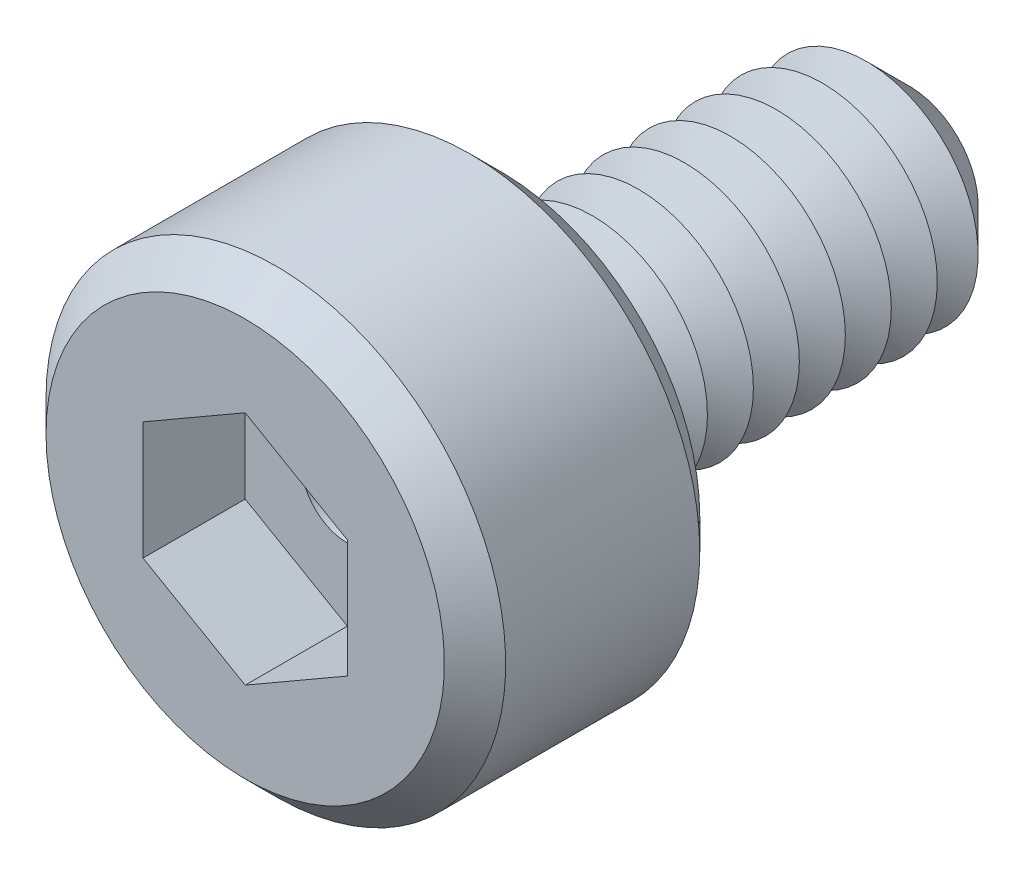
ISO-10303-21;
HEADER;
FILE_DESCRIPTION(('STEP AP214'),'2;1');
FILE_NAME('part.step','',(''),(''),'','','');
FILE_SCHEMA(('AUTOMOTIVE_DESIGN { 1 0 10303 214 1 1 1 1 }'));
ENDSEC;
DATA;
#1=APPLICATION_CONTEXT('core data for automotive mechanical design processes');
#2=APPLICATION_PROTOCOL_DEFINITION('international standard','automotive_design',2000,#1);
#3=PRODUCT_CONTEXT('',#1,'mechanical');
#4=PRODUCT('Part','Part','',(#3));
#5=PRODUCT_RELATED_PRODUCT_CATEGORY('part','',(#4));
#6=PRODUCT_DEFINITION_FORMATION('','',#4);
#7=PRODUCT_DEFINITION_CONTEXT('part definition',#1,'design');
#8=PRODUCT_DEFINITION('design','',#6,#7);
#9=PRODUCT_DEFINITION_SHAPE('','',#8);
#10=(LENGTH_UNIT() NAMED_UNIT(*) SI_UNIT(.MILLI.,.METRE.));
#11=(NAMED_UNIT(*) PLANE_ANGLE_UNIT() SI_UNIT($,.RADIAN.));
#12=(NAMED_UNIT(*) SI_UNIT($,.STERADIAN.) SOLID_ANGLE_UNIT());
#13=UNCERTAINTY_MEASURE_WITH_UNIT(LENGTH_MEASURE(1.E-05),#10,'distance_accuracy_value','');
#14=(GEOMETRIC_REPRESENTATION_CONTEXT(3) GLOBAL_UNCERTAINTY_ASSIGNED_CONTEXT((#13)) GLOBAL_UNIT_ASSIGNED_CONTEXT((#10,
#11,#12)) REPRESENTATION_CONTEXT('',''));
#15=CARTESIAN_POINT('',(0.,0.,0.));
#16=DIRECTION('',(0.,0.,1.));
#17=DIRECTION('',(1.,0.,0.));
#18=AXIS2_PLACEMENT_3D('',#15,#16,#17);
#19=CARTESIAN_POINT('',(0.,0.,2.5));
#20=DIRECTION('',(0.,0.,-1.));
#21=DIRECTION('',(-1.,0.,0.));
#22=AXIS2_PLACEMENT_3D('',#19,#20,#21);
#23=CYLINDRICAL_SURFACE('',#22,2.25);
#24=CARTESIAN_POINT('',(0.,0.,0.299999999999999));
#25=DIRECTION('',(0.,0.,1.));
#26=DIRECTION('',(1.,0.,0.));
#27=AXIS2_PLACEMENT_3D('',#24,#25,#26);
#28=CIRCLE('',#27,2.25);
#29=CARTESIAN_POINT('',(2.25,0.,0.299999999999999));
#30=VERTEX_POINT('',#29);
#31=EDGE_CURVE('E240',#30,#30,#28,.T.);
#32=ORIENTED_EDGE('',*,*,#31,.T.);
#33=EDGE_LOOP('',(#32));
#34=FACE_BOUND('',#33,.T.);
#35=CARTESIAN_POINT('',(0.,0.,2.2));
#36=DIRECTION('',(0.,0.,1.));
#37=DIRECTION('',(1.,0.,0.));
#38=AXIS2_PLACEMENT_3D('',#35,#36,#37);
#39=CIRCLE('',#38,2.25);
#40=CARTESIAN_POINT('',(-2.25,0.,2.2));
#41=VERTEX_POINT('',#40);
#42=EDGE_CURVE('E233',#41,#41,#39,.F.);
#43=ORIENTED_EDGE('',*,*,#42,.T.);
#44=EDGE_LOOP('',(#43));
#45=FACE_BOUND('',#44,.T.);
#46=ADVANCED_FACE('F39',(#34,#45),#23,.T.);
#47=CARTESIAN_POINT('',(0.,0.,2.5));
#48=DIRECTION('',(0.,0.,1.));
#49=DIRECTION('',(1.,0.,0.));
#50=AXIS2_PLACEMENT_3D('',#47,#48,#49);
#51=PLANE('',#50);
#52=CARTESIAN_POINT('',(0.,0.,2.5));
#53=DIRECTION('',(0.,0.,1.));
#54=DIRECTION('',(1.,0.,0.));
#55=AXIS2_PLACEMENT_3D('',#52,#53,#54);
#56=CIRCLE('',#55,1.95);
#57=CARTESIAN_POINT('',(-1.95,0.,2.5));
#58=VERTEX_POINT('',#57);
#59=EDGE_CURVE('E11',#58,#58,#56,.T.);
#60=ORIENTED_EDGE('',*,*,#59,.T.);
#61=EDGE_LOOP('',(#60));
#62=FACE_BOUND('',#61,.T.);
#63=DIRECTION('',(-0.866025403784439,0.5,0.));
#64=VECTOR('',#63,1.);
#65=CARTESIAN_POINT('',(1.,0.577350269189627,2.5));
#66=LINE('',#65,#64);
#67=CARTESIAN_POINT('',(1.,0.577350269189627,2.5));
#68=VERTEX_POINT('',#67);
#69=CARTESIAN_POINT('',(0.,1.15470053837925,2.5));
#70=VERTEX_POINT('',#69);
#71=EDGE_CURVE('E55',#68,#70,#66,.T.);
#72=ORIENTED_EDGE('',*,*,#71,.F.);
#73=DIRECTION('',(0.,1.,0.));
#74=VECTOR('',#73,1.);
#75=CARTESIAN_POINT('',(1.,-0.577350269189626,2.5));
#76=LINE('',#75,#74);
#77=CARTESIAN_POINT('',(1.,-0.577350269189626,2.5));
#78=VERTEX_POINT('',#77);
#79=EDGE_CURVE('E150',#78,#68,#76,.T.);
#80=ORIENTED_EDGE('',*,*,#79,.F.);
#81=DIRECTION('',(0.866025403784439,0.5,0.));
#82=VECTOR('',#81,1.);
#83=CARTESIAN_POINT('',(0.,-1.15470053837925,2.5));
#84=LINE('',#83,#82);
#85=CARTESIAN_POINT('',(0.,-1.15470053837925,2.5));
#86=VERTEX_POINT('',#85);
#87=EDGE_CURVE('E147',#86,#78,#84,.T.);
#88=ORIENTED_EDGE('',*,*,#87,.F.);
#89=DIRECTION('',(0.866025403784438,-0.5,0.));
#90=VECTOR('',#89,1.);
#91=CARTESIAN_POINT('',(-1.,-0.577350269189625,2.5));
#92=LINE('',#91,#90);
#93=CARTESIAN_POINT('',(-1.,-0.577350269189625,2.5));
#94=VERTEX_POINT('',#93);
#95=EDGE_CURVE('E103',#94,#86,#92,.T.);
#96=ORIENTED_EDGE('',*,*,#95,.F.);
#97=DIRECTION('',(0.,-1.,0.));
#98=VECTOR('',#97,1.);
#99=CARTESIAN_POINT('',(-1.,0.577350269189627,2.5));
#100=LINE('',#99,#98);
#101=CARTESIAN_POINT('',(-1.,0.577350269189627,2.5));
#102=VERTEX_POINT('',#101);
#103=EDGE_CURVE('E142',#102,#94,#100,.T.);
#104=ORIENTED_EDGE('',*,*,#103,.F.);
#105=DIRECTION('',(-0.866025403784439,-0.5,0.));
#106=VECTOR('',#105,1.);
#107=CARTESIAN_POINT('',(0.,1.15470053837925,2.5));
#108=LINE('',#107,#106);
#109=EDGE_CURVE('E137',#70,#102,#108,.T.);
#110=ORIENTED_EDGE('',*,*,#109,.F.);
#111=EDGE_LOOP('',(#72,#80,#88,#96,#104,#110));
#112=FACE_BOUND('',#111,.T.);
#113=ADVANCED_FACE('F258',(#62,#112),#51,.T.);
#114=CARTESIAN_POINT('',(0.,0.,0.));
#115=DIRECTION('',(0.,0.,1.));
#116=DIRECTION('',(1.,0.,0.));
#117=AXIS2_PLACEMENT_3D('',#114,#115,#116);
#118=PLANE('',#117);
#119=CARTESIAN_POINT('',(0.,0.,0.));
#120=DIRECTION('',(0.,0.,1.));
#121=DIRECTION('',(1.,0.,0.));
#122=AXIS2_PLACEMENT_3D('',#119,#120,#121);
#123=CIRCLE('',#122,1.95);
#124=CARTESIAN_POINT('',(1.95,0.,0.));
#125=VERTEX_POINT('',#124);
#126=EDGE_CURVE('E48',#125,#125,#123,.F.);
#127=ORIENTED_EDGE('',*,*,#126,.T.);
#128=EDGE_LOOP('',(#127));
#129=FACE_BOUND('',#128,.T.);
#130=CARTESIAN_POINT('',(0.,0.,0.));
#131=DIRECTION('',(0.,0.,1.));
#132=DIRECTION('',(1.,0.,0.));
#133=AXIS2_PLACEMENT_3D('',#130,#131,#132);
#134=CIRCLE('',#133,1.125);
#135=CARTESIAN_POINT('',(1.125,0.,0.));
#136=VERTEX_POINT('',#135);
#137=EDGE_CURVE('E225',#136,#136,#134,.T.);
#138=ORIENTED_EDGE('',*,*,#137,.T.);
#139=EDGE_LOOP('',(#138));
#140=FACE_BOUND('',#139,.T.);
#141=ADVANCED_FACE('F247',(#129,#140),#118,.F.);
#142=CARTESIAN_POINT('',(0.,0.,0.));
#143=DIRECTION('',(0.,0.,1.));
#144=DIRECTION('',(1.,0.,0.));
#145=AXIS2_PLACEMENT_3D('',#142,#143,#144);
#146=CONICAL_SURFACE('',#145,1.125,1.0471975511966);
#147=CARTESIAN_POINT('',(0.,0.,-0.225));
#148=DIRECTION('',(0.,0.,1.));
#149=DIRECTION('',(1.,0.,0.));
#150=AXIS2_PLACEMENT_3D('',#147,#148,#149);
#151=CIRCLE('',#150,0.735288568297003);
#152=CARTESIAN_POINT('',(0.735288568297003,0.,-0.225));
#153=VERTEX_POINT('',#152);
#154=EDGE_CURVE('E221',#153,#153,#151,.T.);
#155=ORIENTED_EDGE('',*,*,#154,.T.);
#156=EDGE_LOOP('',(#155));
#157=FACE_BOUND('',#156,.T.);
#158=ORIENTED_EDGE('',*,*,#137,.F.);
#159=EDGE_LOOP('',(#158));
#160=FACE_BOUND('',#159,.T.);
#161=ADVANCED_FACE('F372',(#157,#160),#146,.T.);
#162=CARTESIAN_POINT('',(0.,0.,-0.225));
#163=DIRECTION('',(0.,0.,-1.));
#164=DIRECTION('',(-1.,0.,0.));
#165=AXIS2_PLACEMENT_3D('',#162,#163,#164);
#166=CONICAL_SURFACE('',#165,0.735288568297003,1.0471975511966);
#167=CARTESIAN_POINT('',(0.,0.,-0.45));
#168=DIRECTION('',(0.,0.,1.));
#169=DIRECTION('',(1.,0.,0.));
#170=AXIS2_PLACEMENT_3D('',#167,#168,#169);
#171=CIRCLE('',#170,1.125);
#172=CARTESIAN_POINT('',(1.125,0.,-0.45));
#173=VERTEX_POINT('',#172);
#174=EDGE_CURVE('E217',#173,#173,#171,.T.);
#175=ORIENTED_EDGE('',*,*,#174,.T.);
#176=EDGE_LOOP('',(#175));
#177=FACE_BOUND('',#176,.T.);
#178=ORIENTED_EDGE('',*,*,#154,.F.);
#179=EDGE_LOOP('',(#178));
#180=FACE_BOUND('',#179,.T.);
#181=ADVANCED_FACE('F368',(#177,#180),#166,.T.);
#182=CARTESIAN_POINT('',(0.,0.,-0.45));
#183=DIRECTION('',(0.,0.,1.));
#184=DIRECTION('',(1.,0.,0.));
#185=AXIS2_PLACEMENT_3D('',#182,#183,#184);
#186=CONICAL_SURFACE('',#185,1.125,1.0471975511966);
#187=CARTESIAN_POINT('',(0.,0.,-0.675));
#188=DIRECTION('',(0.,0.,1.));
#189=DIRECTION('',(1.,0.,0.));
#190=AXIS2_PLACEMENT_3D('',#187,#188,#189);
#191=CIRCLE('',#190,0.735288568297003);
#192=CARTESIAN_POINT('',(0.735288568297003,0.,-0.675));
#193=VERTEX_POINT('',#192);
#194=EDGE_CURVE('E213',#193,#193,#191,.T.);
#195=ORIENTED_EDGE('',*,*,#194,.T.);
#196=EDGE_LOOP('',(#195));
#197=FACE_BOUND('',#196,.T.);
#198=ORIENTED_EDGE('',*,*,#174,.F.);
#199=EDGE_LOOP('',(#198));
#200=FACE_BOUND('',#199,.T.);
#201=ADVANCED_FACE('F364',(#197,#200),#186,.T.);
#202=CARTESIAN_POINT('',(0.,0.,-0.675));
#203=DIRECTION('',(0.,0.,-1.));
#204=DIRECTION('',(-1.,0.,0.));
#205=AXIS2_PLACEMENT_3D('',#202,#203,#204);
#206=CONICAL_SURFACE('',#205,0.735288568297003,1.0471975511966);
#207=CARTESIAN_POINT('',(0.,0.,-0.9));
#208=DIRECTION('',(0.,0.,1.));
#209=DIRECTION('',(1.,0.,0.));
#210=AXIS2_PLACEMENT_3D('',#207,#208,#209);
#211=CIRCLE('',#210,1.125);
#212=CARTESIAN_POINT('',(1.125,0.,-0.9));
#213=VERTEX_POINT('',#212);
#214=EDGE_CURVE('E210',#213,#213,#211,.T.);
#215=ORIENTED_EDGE('',*,*,#214,.T.);
#216=EDGE_LOOP('',(#215));
#217=FACE_BOUND('',#216,.T.);
#218=ORIENTED_EDGE('',*,*,#194,.F.);
#219=EDGE_LOOP('',(#218));
#220=FACE_BOUND('',#219,.T.);
#221=ADVANCED_FACE('F360',(#217,#220),#206,.T.);
#222=CARTESIAN_POINT('',(0.,0.,-0.9));
#223=DIRECTION('',(0.,0.,1.));
#224=DIRECTION('',(1.,0.,0.));
#225=AXIS2_PLACEMENT_3D('',#222,#223,#224);
#226=CONICAL_SURFACE('',#225,1.125,1.0471975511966);
#227=CARTESIAN_POINT('',(0.,0.,-1.125));
#228=DIRECTION('',(0.,0.,1.));
#229=DIRECTION('',(1.,0.,0.));
#230=AXIS2_PLACEMENT_3D('',#227,#228,#229);
#231=CIRCLE('',#230,0.735288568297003);
#232=CARTESIAN_POINT('',(0.735288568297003,0.,-1.125));
#233=VERTEX_POINT('',#232);
#234=EDGE_CURVE('E206',#233,#233,#231,.T.);
#235=ORIENTED_EDGE('',*,*,#234,.T.);
#236=EDGE_LOOP('',(#235));
#237=FACE_BOUND('',#236,.T.);
#238=ORIENTED_EDGE('',*,*,#214,.F.);
#239=EDGE_LOOP('',(#238));
#240=FACE_BOUND('',#239,.T.);
#241=ADVANCED_FACE('F356',(#237,#240),#226,.T.);
#242=CARTESIAN_POINT('',(0.,0.,-1.125));
#243=DIRECTION('',(0.,0.,-1.));
#244=DIRECTION('',(-1.,0.,0.));
#245=AXIS2_PLACEMENT_3D('',#242,#243,#244);
#246=CONICAL_SURFACE('',#245,0.735288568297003,1.0471975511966);
#247=CARTESIAN_POINT('',(0.,0.,-1.35));
#248=DIRECTION('',(0.,0.,1.));
#249=DIRECTION('',(1.,0.,0.));
#250=AXIS2_PLACEMENT_3D('',#247,#248,#249);
#251=CIRCLE('',#250,1.125);
#252=CARTESIAN_POINT('',(1.125,0.,-1.35));
#253=VERTEX_POINT('',#252);
#254=EDGE_CURVE('E202',#253,#253,#251,.T.);
#255=ORIENTED_EDGE('',*,*,#254,.T.);
#256=EDGE_LOOP('',(#255));
#257=FACE_BOUND('',#256,.T.);
#258=ORIENTED_EDGE('',*,*,#234,.F.);
#259=EDGE_LOOP('',(#258));
#260=FACE_BOUND('',#259,.T.);
#261=ADVANCED_FACE('F352',(#257,#260),#246,.T.);
#262=CARTESIAN_POINT('',(0.,0.,-1.35));
#263=DIRECTION('',(0.,0.,1.));
#264=DIRECTION('',(1.,0.,0.));
#265=AXIS2_PLACEMENT_3D('',#262,#263,#264);
#266=CONICAL_SURFACE('',#265,1.125,1.0471975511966);
#267=CARTESIAN_POINT('',(0.,0.,-1.575));
#268=DIRECTION('',(0.,0.,1.));
#269=DIRECTION('',(1.,0.,0.));
#270=AXIS2_PLACEMENT_3D('',#267,#268,#269);
#271=CIRCLE('',#270,0.735288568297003);
#272=CARTESIAN_POINT('',(0.735288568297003,0.,-1.575));
#273=VERTEX_POINT('',#272);
#274=EDGE_CURVE('E198',#273,#273,#271,.T.);
#275=ORIENTED_EDGE('',*,*,#274,.T.);
#276=EDGE_LOOP('',(#275));
#277=FACE_BOUND('',#276,.T.);
#278=ORIENTED_EDGE('',*,*,#254,.F.);
#279=EDGE_LOOP('',(#278));
#280=FACE_BOUND('',#279,.T.);
#281=ADVANCED_FACE('F348',(#277,#280),#266,.T.);
#282=CARTESIAN_POINT('',(0.,0.,-1.575));
#283=DIRECTION('',(0.,0.,-1.));
#284=DIRECTION('',(-1.,0.,0.));
#285=AXIS2_PLACEMENT_3D('',#282,#283,#284);
#286=CONICAL_SURFACE('',#285,0.735288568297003,1.0471975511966);
#287=CARTESIAN_POINT('',(0.,0.,-1.8));
#288=DIRECTION('',(0.,0.,1.));
#289=DIRECTION('',(1.,0.,0.));
#290=AXIS2_PLACEMENT_3D('',#287,#288,#289);
#291=CIRCLE('',#290,1.125);
#292=CARTESIAN_POINT('',(1.125,0.,-1.8));
#293=VERTEX_POINT('',#292);
#294=EDGE_CURVE('E194',#293,#293,#291,.T.);
#295=ORIENTED_EDGE('',*,*,#294,.T.);
#296=EDGE_LOOP('',(#295));
#297=FACE_BOUND('',#296,.T.);
#298=ORIENTED_EDGE('',*,*,#274,.F.);
#299=EDGE_LOOP('',(#298));
#300=FACE_BOUND('',#299,.T.);
#301=ADVANCED_FACE('F344',(#297,#300),#286,.T.);
#302=CARTESIAN_POINT('',(0.,0.,-1.8));
#303=DIRECTION('',(0.,0.,1.));
#304=DIRECTION('',(1.,0.,0.));
#305=AXIS2_PLACEMENT_3D('',#302,#303,#304);
#306=CONICAL_SURFACE('',#305,1.125,1.0471975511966);
#307=CARTESIAN_POINT('',(0.,0.,-2.025));
#308=DIRECTION('',(0.,0.,1.));
#309=DIRECTION('',(1.,0.,0.));
#310=AXIS2_PLACEMENT_3D('',#307,#308,#309);
#311=CIRCLE('',#310,0.735288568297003);
#312=CARTESIAN_POINT('',(0.735288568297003,0.,-2.025));
#313=VERTEX_POINT('',#312);
#314=EDGE_CURVE('E190',#313,#313,#311,.T.);
#315=ORIENTED_EDGE('',*,*,#314,.T.);
#316=EDGE_LOOP('',(#315));
#317=FACE_BOUND('',#316,.T.);
#318=ORIENTED_EDGE('',*,*,#294,.F.);
#319=EDGE_LOOP('',(#318));
#320=FACE_BOUND('',#319,.T.);
#321=ADVANCED_FACE('F340',(#317,#320),#306,.T.);
#322=CARTESIAN_POINT('',(0.,0.,-2.025));
#323=DIRECTION('',(0.,0.,-1.));
#324=DIRECTION('',(-1.,0.,0.));
#325=AXIS2_PLACEMENT_3D('',#322,#323,#324);
#326=CONICAL_SURFACE('',#325,0.735288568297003,1.0471975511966);
#327=CARTESIAN_POINT('',(0.,0.,-2.25));
#328=DIRECTION('',(0.,0.,1.));
#329=DIRECTION('',(1.,0.,0.));
#330=AXIS2_PLACEMENT_3D('',#327,#328,#329);
#331=CIRCLE('',#330,1.125);
#332=CARTESIAN_POINT('',(1.125,0.,-2.25));
#333=VERTEX_POINT('',#332);
#334=EDGE_CURVE('E186',#333,#333,#331,.T.);
#335=ORIENTED_EDGE('',*,*,#334,.T.);
#336=EDGE_LOOP('',(#335));
#337=FACE_BOUND('',#336,.T.);
#338=ORIENTED_EDGE('',*,*,#314,.F.);
#339=EDGE_LOOP('',(#338));
#340=FACE_BOUND('',#339,.T.);
#341=ADVANCED_FACE('F336',(#337,#340),#326,.T.);
#342=CARTESIAN_POINT('',(0.,0.,-2.25));
#343=DIRECTION('',(0.,0.,1.));
#344=DIRECTION('',(1.,0.,0.));
#345=AXIS2_PLACEMENT_3D('',#342,#343,#344);
#346=CONICAL_SURFACE('',#345,1.125,1.0471975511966);
#347=CARTESIAN_POINT('',(0.,0.,-2.475));
#348=DIRECTION('',(0.,0.,1.));
#349=DIRECTION('',(1.,0.,0.));
#350=AXIS2_PLACEMENT_3D('',#347,#348,#349);
#351=CIRCLE('',#350,0.735288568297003);
#352=CARTESIAN_POINT('',(0.735288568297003,0.,-2.475));
#353=VERTEX_POINT('',#352);
#354=EDGE_CURVE('E182',#353,#353,#351,.T.);
#355=ORIENTED_EDGE('',*,*,#354,.T.);
#356=EDGE_LOOP('',(#355));
#357=FACE_BOUND('',#356,.T.);
#358=ORIENTED_EDGE('',*,*,#334,.F.);
#359=EDGE_LOOP('',(#358));
#360=FACE_BOUND('',#359,.T.);
#361=ADVANCED_FACE('F332',(#357,#360),#346,.T.);
#362=CARTESIAN_POINT('',(0.,0.,-2.475));
#363=DIRECTION('',(0.,0.,-1.));
#364=DIRECTION('',(-1.,0.,0.));
#365=AXIS2_PLACEMENT_3D('',#362,#363,#364);
#366=CONICAL_SURFACE('',#365,0.735288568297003,1.0471975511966);
#367=CARTESIAN_POINT('',(0.,0.,-2.7));
#368=DIRECTION('',(0.,0.,1.));
#369=DIRECTION('',(1.,0.,0.));
#370=AXIS2_PLACEMENT_3D('',#367,#368,#369);
#371=CIRCLE('',#370,1.125);
#372=CARTESIAN_POINT('',(1.125,0.,-2.7));
#373=VERTEX_POINT('',#372);
#374=EDGE_CURVE('E178',#373,#373,#371,.T.);
#375=ORIENTED_EDGE('',*,*,#374,.T.);
#376=EDGE_LOOP('',(#375));
#377=FACE_BOUND('',#376,.T.);
#378=ORIENTED_EDGE('',*,*,#354,.F.);
#379=EDGE_LOOP('',(#378));
#380=FACE_BOUND('',#379,.T.);
#381=ADVANCED_FACE('F328',(#377,#380),#366,.T.);
#382=CARTESIAN_POINT('',(0.,0.,-2.7));
#383=DIRECTION('',(0.,0.,1.));
#384=DIRECTION('',(1.,0.,0.));
#385=AXIS2_PLACEMENT_3D('',#382,#383,#384);
#386=CONICAL_SURFACE('',#385,1.125,1.0471975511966);
#387=CARTESIAN_POINT('',(0.,0.,-2.925));
#388=DIRECTION('',(0.,0.,1.));
#389=DIRECTION('',(1.,0.,0.));
#390=AXIS2_PLACEMENT_3D('',#387,#388,#389);
#391=CIRCLE('',#390,0.735288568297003);
#392=CARTESIAN_POINT('',(0.735288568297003,0.,-2.925));
#393=VERTEX_POINT('',#392);
#394=EDGE_CURVE('E174',#393,#393,#391,.T.);
#395=ORIENTED_EDGE('',*,*,#394,.T.);
#396=EDGE_LOOP('',(#395));
#397=FACE_BOUND('',#396,.T.);
#398=ORIENTED_EDGE('',*,*,#374,.F.);
#399=EDGE_LOOP('',(#398));
#400=FACE_BOUND('',#399,.T.);
#401=ADVANCED_FACE('F324',(#397,#400),#386,.T.);
#402=CARTESIAN_POINT('',(0.,0.,-2.925));
#403=DIRECTION('',(0.,0.,-1.));
#404=DIRECTION('',(-1.,0.,0.));
#405=AXIS2_PLACEMENT_3D('',#402,#403,#404);
#406=CONICAL_SURFACE('',#405,0.735288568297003,1.0471975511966);
#407=CARTESIAN_POINT('',(0.,0.,-3.15));
#408=DIRECTION('',(0.,0.,1.));
#409=DIRECTION('',(1.,0.,0.));
#410=AXIS2_PLACEMENT_3D('',#407,#408,#409);
#411=CIRCLE('',#410,1.125);
#412=CARTESIAN_POINT('',(1.125,0.,-3.15));
#413=VERTEX_POINT('',#412);
#414=EDGE_CURVE('E169',#413,#413,#411,.T.);
#415=ORIENTED_EDGE('',*,*,#414,.T.);
#416=EDGE_LOOP('',(#415));
#417=FACE_BOUND('',#416,.T.);
#418=ORIENTED_EDGE('',*,*,#394,.F.);
#419=EDGE_LOOP('',(#418));
#420=FACE_BOUND('',#419,.T.);
#421=ADVANCED_FACE('F320',(#417,#420),#406,.T.);
#422=CARTESIAN_POINT('',(0.,0.,-3.15));
#423=DIRECTION('',(0.,0.,1.));
#424=DIRECTION('',(1.,0.,0.));
#425=AXIS2_PLACEMENT_3D('',#422,#423,#424);
#426=CONICAL_SURFACE('',#425,1.125,1.0471975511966);
#427=CARTESIAN_POINT('',(0.,0.,-3.375));
#428=DIRECTION('',(0.,0.,1.));
#429=DIRECTION('',(1.,0.,0.));
#430=AXIS2_PLACEMENT_3D('',#427,#428,#429);
#431=CIRCLE('',#430,0.735288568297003);
#432=CARTESIAN_POINT('',(0.735288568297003,0.,-3.375));
#433=VERTEX_POINT('',#432);
#434=EDGE_CURVE('E156',#433,#433,#431,.T.);
#435=ORIENTED_EDGE('',*,*,#434,.T.);
#436=EDGE_LOOP('',(#435));
#437=FACE_BOUND('',#436,.T.);
#438=ORIENTED_EDGE('',*,*,#414,.F.);
#439=EDGE_LOOP('',(#438));
#440=FACE_BOUND('',#439,.T.);
#441=ADVANCED_FACE('F316',(#437,#440),#426,.T.);
#442=CARTESIAN_POINT('',(0.,0.,-3.375));
#443=DIRECTION('',(0.,0.,-1.));
#444=DIRECTION('',(-1.,0.,0.));
#445=AXIS2_PLACEMENT_3D('',#442,#443,#444);
#446=CONICAL_SURFACE('',#445,0.735288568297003,1.0471975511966);
#447=CARTESIAN_POINT('',(0.,0.,-3.58169872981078));
#448=DIRECTION('',(0.,0.,-1.));
#449=DIRECTION('',(-1.,0.,0.));
#450=AXIS2_PLACEMENT_3D('',#447,#448,#449);
#451=CIRCLE('',#450,1.09330127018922);
#452=CARTESIAN_POINT('',(-1.09330127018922,0.,-3.58169872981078));
#453=VERTEX_POINT('',#452);
#454=EDGE_CURVE('E173',#453,#453,#451,.T.);
#455=ORIENTED_EDGE('',*,*,#454,.F.);
#456=EDGE_LOOP('',(#455));
#457=FACE_BOUND('',#456,.T.);
#458=ORIENTED_EDGE('',*,*,#434,.F.);
#459=EDGE_LOOP('',(#458));
#460=FACE_BOUND('',#459,.T.);
#461=ADVANCED_FACE('F312',(#457,#460),#446,.T.);
#462=CARTESIAN_POINT('',(0.,0.,-4.));
#463=DIRECTION('',(0.,0.,-1.));
#464=DIRECTION('',(-1.,0.,0.));
#465=AXIS2_PLACEMENT_3D('',#462,#463,#464);
#466=PLANE('',#465);
#467=CARTESIAN_POINT('',(0.,0.,-4.));
#468=DIRECTION('',(0.,0.,-1.));
#469=DIRECTION('',(-1.,0.,0.));
#470=AXIS2_PLACEMENT_3D('',#467,#468,#469);
#471=CIRCLE('',#470,0.45);
#472=CARTESIAN_POINT('',(-0.45,0.,-4.));
#473=VERTEX_POINT('',#472);
#474=EDGE_CURVE('E138',#473,#473,#471,.F.);
#475=ORIENTED_EDGE('',*,*,#474,.T.);
#476=EDGE_LOOP('',(#475));
#477=FACE_BOUND('',#476,.T.);
#478=CARTESIAN_POINT('',(0.,0.,-4.));
#479=DIRECTION('',(0.,0.,-1.));
#480=DIRECTION('',(-1.,0.,0.));
#481=AXIS2_PLACEMENT_3D('',#478,#479,#480);
#482=CIRCLE('',#481,0.675);
#483=CARTESIAN_POINT('',(-0.675,0.,-4.));
#484=VERTEX_POINT('',#483);
#485=EDGE_CURVE('E229',#484,#484,#482,.T.);
#486=ORIENTED_EDGE('',*,*,#485,.T.);
#487=EDGE_LOOP('',(#486));
#488=FACE_BOUND('',#487,.T.);
#489=ADVANCED_FACE('F315',(#477,#488),#466,.T.);
#490=CARTESIAN_POINT('',(0.,0.,-4.));
#491=DIRECTION('',(0.,0.,1.));
#492=DIRECTION('',(1.,0.,0.));
#493=AXIS2_PLACEMENT_3D('',#490,#491,#492);
#494=CONICAL_SURFACE('',#493,0.675,0.785398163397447);
#495=ORIENTED_EDGE('',*,*,#485,.F.);
#496=EDGE_LOOP('',(#495));
#497=FACE_BOUND('',#496,.T.);
#498=ORIENTED_EDGE('',*,*,#454,.T.);
#499=EDGE_LOOP('',(#498));
#500=FACE_BOUND('',#499,.T.);
#501=ADVANCED_FACE('F311',(#497,#500),#494,.T.);
#502=CARTESIAN_POINT('',(1.,0.577350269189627,1.5));
#503=DIRECTION('',(0.5,0.866025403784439,0.));
#504=DIRECTION('',(-0.866025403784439,0.5,0.));
#505=AXIS2_PLACEMENT_3D('',#502,#503,#504);
#506=PLANE('',#505);
#507=ORIENTED_EDGE('',*,*,#71,.T.);
#508=DIRECTION('',(0.,0.,1.));
#509=VECTOR('',#508,1.);
#510=CARTESIAN_POINT('',(0.,1.15470053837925,1.5));
#511=LINE('',#510,#509);
#512=CARTESIAN_POINT('',(0.,1.15470053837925,1.5));
#513=VERTEX_POINT('',#512);
#514=EDGE_CURVE('E85',#513,#70,#511,.T.);
#515=ORIENTED_EDGE('',*,*,#514,.F.);
#516=DIRECTION('',(-0.866025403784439,0.5,0.));
#517=VECTOR('',#516,1.);
#518=CARTESIAN_POINT('',(1.,0.577350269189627,1.5));
#519=LINE('',#518,#517);
#520=CARTESIAN_POINT('',(1.,0.577350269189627,1.5));
#521=VERTEX_POINT('',#520);
#522=EDGE_CURVE('E153',#521,#513,#519,.T.);
#523=ORIENTED_EDGE('',*,*,#522,.F.);
#524=DIRECTION('',(0.,0.,1.));
#525=VECTOR('',#524,1.);
#526=CARTESIAN_POINT('',(1.,0.577350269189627,1.5));
#527=LINE('',#526,#525);
#528=EDGE_CURVE('E63',#521,#68,#527,.T.);
#529=ORIENTED_EDGE('',*,*,#528,.T.);
#530=EDGE_LOOP('',(#507,#515,#523,#529));
#531=FACE_BOUND('',#530,.T.);
#532=ADVANCED_FACE('F301',(#531),#506,.F.);
#533=CARTESIAN_POINT('',(1.,-0.577350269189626,1.5));
#534=DIRECTION('',(1.,0.,0.));
#535=DIRECTION('',(0.,0.,-1.));
#536=AXIS2_PLACEMENT_3D('',#533,#534,#535);
#537=PLANE('',#536);
#538=ORIENTED_EDGE('',*,*,#79,.T.);
#539=ORIENTED_EDGE('',*,*,#528,.F.);
#540=DIRECTION('',(0.,1.,0.));
#541=VECTOR('',#540,1.);
#542=CARTESIAN_POINT('',(1.,-0.577350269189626,1.5));
#543=LINE('',#542,#541);
#544=CARTESIAN_POINT('',(1.,-0.577350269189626,1.5));
#545=VERTEX_POINT('',#544);
#546=EDGE_CURVE('E117',#545,#521,#543,.T.);
#547=ORIENTED_EDGE('',*,*,#546,.F.);
#548=DIRECTION('',(0.,0.,1.));
#549=VECTOR('',#548,1.);
#550=CARTESIAN_POINT('',(1.,-0.577350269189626,1.5));
#551=LINE('',#550,#549);
#552=EDGE_CURVE('E108',#545,#78,#551,.T.);
#553=ORIENTED_EDGE('',*,*,#552,.T.);
#554=EDGE_LOOP('',(#538,#539,#547,#553));
#555=FACE_BOUND('',#554,.T.);
#556=ADVANCED_FACE('F298',(#555),#537,.F.);
#557=CARTESIAN_POINT('',(0.,-1.15470053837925,1.5));
#558=DIRECTION('',(0.5,-0.866025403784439,0.));
#559=DIRECTION('',(0.866025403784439,0.5,0.));
#560=AXIS2_PLACEMENT_3D('',#557,#558,#559);
#561=PLANE('',#560);
#562=ORIENTED_EDGE('',*,*,#87,.T.);
#563=ORIENTED_EDGE('',*,*,#552,.F.);
#564=DIRECTION('',(0.866025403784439,0.5,0.));
#565=VECTOR('',#564,1.);
#566=CARTESIAN_POINT('',(0.,-1.15470053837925,1.5));
#567=LINE('',#566,#565);
#568=CARTESIAN_POINT('',(0.,-1.15470053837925,1.5));
#569=VERTEX_POINT('',#568);
#570=EDGE_CURVE('E112',#569,#545,#567,.T.);
#571=ORIENTED_EDGE('',*,*,#570,.F.);
#572=DIRECTION('',(0.,0.,1.));
#573=VECTOR('',#572,1.);
#574=CARTESIAN_POINT('',(0.,-1.15470053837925,1.5));
#575=LINE('',#574,#573);
#576=EDGE_CURVE('E96',#569,#86,#575,.T.);
#577=ORIENTED_EDGE('',*,*,#576,.T.);
#578=EDGE_LOOP('',(#562,#563,#571,#577));
#579=FACE_BOUND('',#578,.T.);
#580=ADVANCED_FACE('F113',(#579),#561,.F.);
#581=CARTESIAN_POINT('',(-1.,-0.577350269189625,1.5));
#582=DIRECTION('',(-0.5,-0.866025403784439,0.));
#583=DIRECTION('',(0.866025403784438,-0.5,0.));
#584=AXIS2_PLACEMENT_3D('',#581,#582,#583);
#585=PLANE('',#584);
#586=ORIENTED_EDGE('',*,*,#95,.T.);
#587=ORIENTED_EDGE('',*,*,#576,.F.);
#588=DIRECTION('',(0.866025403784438,-0.5,0.));
#589=VECTOR('',#588,1.);
#590=CARTESIAN_POINT('',(-1.,-0.577350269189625,1.5));
#591=LINE('',#590,#589);
#592=CARTESIAN_POINT('',(-1.,-0.577350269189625,1.5));
#593=VERTEX_POINT('',#592);
#594=EDGE_CURVE('E100',#593,#569,#591,.T.);
#595=ORIENTED_EDGE('',*,*,#594,.F.);
#596=DIRECTION('',(0.,0.,1.));
#597=VECTOR('',#596,1.);
#598=CARTESIAN_POINT('',(-1.,-0.577350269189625,1.5));
#599=LINE('',#598,#597);
#600=EDGE_CURVE('E109',#593,#94,#599,.T.);
#601=ORIENTED_EDGE('',*,*,#600,.T.);
#602=EDGE_LOOP('',(#586,#587,#595,#601));
#603=FACE_BOUND('',#602,.T.);
#604=ADVANCED_FACE('F98',(#603),#585,.F.);
#605=CARTESIAN_POINT('',(-1.,0.577350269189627,1.5));
#606=DIRECTION('',(-1.,0.,0.));
#607=DIRECTION('',(0.,0.,1.));
#608=AXIS2_PLACEMENT_3D('',#605,#606,#607);
#609=PLANE('',#608);
#610=ORIENTED_EDGE('',*,*,#103,.T.);
#611=ORIENTED_EDGE('',*,*,#600,.F.);
#612=DIRECTION('',(0.,-1.,0.));
#613=VECTOR('',#612,1.);
#614=CARTESIAN_POINT('',(-1.,0.577350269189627,1.5));
#615=LINE('',#614,#613);
#616=CARTESIAN_POINT('',(-1.,0.577350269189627,1.5));
#617=VERTEX_POINT('',#616);
#618=EDGE_CURVE('E123',#617,#593,#615,.T.);
#619=ORIENTED_EDGE('',*,*,#618,.F.);
#620=DIRECTION('',(0.,0.,1.));
#621=VECTOR('',#620,1.);
#622=CARTESIAN_POINT('',(-1.,0.577350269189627,1.5));
#623=LINE('',#622,#621);
#624=EDGE_CURVE('E161',#617,#102,#623,.T.);
#625=ORIENTED_EDGE('',*,*,#624,.T.);
#626=EDGE_LOOP('',(#610,#611,#619,#625));
#627=FACE_BOUND('',#626,.T.);
#628=ADVANCED_FACE('F295',(#627),#609,.F.);
#629=CARTESIAN_POINT('',(0.,1.15470053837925,1.5));
#630=DIRECTION('',(-0.5,0.866025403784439,0.));
#631=DIRECTION('',(-0.866025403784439,-0.5,0.));
#632=AXIS2_PLACEMENT_3D('',#629,#630,#631);
#633=PLANE('',#632);
#634=ORIENTED_EDGE('',*,*,#109,.T.);
#635=ORIENTED_EDGE('',*,*,#624,.F.);
#636=DIRECTION('',(-0.866025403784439,-0.5,0.));
#637=VECTOR('',#636,1.);
#638=CARTESIAN_POINT('',(0.,1.15470053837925,1.5));
#639=LINE('',#638,#637);
#640=EDGE_CURVE('E129',#513,#617,#639,.T.);
#641=ORIENTED_EDGE('',*,*,#640,.F.);
#642=ORIENTED_EDGE('',*,*,#514,.T.);
#643=EDGE_LOOP('',(#634,#635,#641,#642));
#644=FACE_BOUND('',#643,.T.);
#645=ADVANCED_FACE('F273',(#644),#633,.F.);
#646=CARTESIAN_POINT('',(0.,0.,1.5));
#647=DIRECTION('',(0.,0.,1.));
#648=DIRECTION('',(1.,0.,0.));
#649=AXIS2_PLACEMENT_3D('',#646,#647,#648);
#650=PLANE('',#649);
#651=CARTESIAN_POINT('',(0.,0.,1.5));
#652=DIRECTION('',(0.,0.,1.));
#653=DIRECTION('',(1.,0.,0.));
#654=AXIS2_PLACEMENT_3D('',#651,#652,#653);
#655=CIRCLE('',#654,0.45);
#656=CARTESIAN_POINT('',(0.45,0.,1.5));
#657=VERTEX_POINT('',#656);
#658=EDGE_CURVE('E281',#657,#657,#655,.T.);
#659=ORIENTED_EDGE('',*,*,#658,.F.);
#660=EDGE_LOOP('',(#659));
#661=FACE_BOUND('',#660,.T.);
#662=ORIENTED_EDGE('',*,*,#522,.T.);
#663=ORIENTED_EDGE('',*,*,#640,.T.);
#664=ORIENTED_EDGE('',*,*,#618,.T.);
#665=ORIENTED_EDGE('',*,*,#594,.T.);
#666=ORIENTED_EDGE('',*,*,#570,.T.);
#667=ORIENTED_EDGE('',*,*,#546,.T.);
#668=EDGE_LOOP('',(#662,#663,#664,#665,#666,#667));
#669=FACE_BOUND('',#668,.T.);
#670=ADVANCED_FACE('F120',(#661,#669),#650,.T.);
#671=CARTESIAN_POINT('',(0.,0.,-5.27279220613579));
#672=DIRECTION('',(0.,0.,1.));
#673=DIRECTION('',(1.,0.,0.));
#674=AXIS2_PLACEMENT_3D('',#671,#672,#673);
#675=CYLINDRICAL_SURFACE('',#674,0.45);
#676=ORIENTED_EDGE('',*,*,#658,.T.);
#677=EDGE_LOOP('',(#676));
#678=FACE_BOUND('',#677,.T.);
#679=ORIENTED_EDGE('',*,*,#474,.F.);
#680=EDGE_LOOP('',(#679));
#681=FACE_BOUND('',#680,.T.);
#682=ADVANCED_FACE('F253',(#678,#681),#675,.F.);
#683=CARTESIAN_POINT('',(0.,0.,0.299999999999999));
#684=DIRECTION('',(0.,0.,1.));
#685=DIRECTION('',(1.,0.,0.));
#686=AXIS2_PLACEMENT_3D('',#683,#684,#685);
#687=CONICAL_SURFACE('',#686,2.25,0.785398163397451);
#688=ORIENTED_EDGE('',*,*,#126,.F.);
#689=EDGE_LOOP('',(#688));
#690=FACE_BOUND('',#689,.T.);
#691=ORIENTED_EDGE('',*,*,#31,.F.);
#692=EDGE_LOOP('',(#691));
#693=FACE_BOUND('',#692,.T.);
#694=ADVANCED_FACE('F250',(#690,#693),#687,.T.);
#695=CARTESIAN_POINT('',(0.,0.,2.5));
#696=DIRECTION('',(0.,0.,-1.));
#697=DIRECTION('',(-1.,0.,0.));
#698=AXIS2_PLACEMENT_3D('',#695,#696,#697);
#699=CONICAL_SURFACE('',#698,1.95,0.785398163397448);
#700=CARTESIAN_POINT('',(-2.25,0.,2.2));
#701=CARTESIAN_POINT('',(-2.246875,0.,2.203125));
#702=CARTESIAN_POINT('',(-2.24375,0.,2.20625));
#703=CARTESIAN_POINT('',(-2.2375,0.,2.2125));
#704=CARTESIAN_POINT('',(-2.234375,0.,2.215625));
#705=CARTESIAN_POINT('',(-2.228125,0.,2.221875));
#706=CARTESIAN_POINT('',(-2.225,0.,2.225));
#707=CARTESIAN_POINT('',(-2.21875,0.,2.23125));
#708=CARTESIAN_POINT('',(-2.215625,0.,2.234375));
#709=CARTESIAN_POINT('',(-2.209375,0.,2.240625));
#710=CARTESIAN_POINT('',(-2.20625,0.,2.24375));
#711=CARTESIAN_POINT('',(-2.2,0.,2.25));
#712=CARTESIAN_POINT('',(-2.196875,0.,2.253125));
#713=CARTESIAN_POINT('',(-2.190625,0.,2.259375));
#714=CARTESIAN_POINT('',(-2.1875,0.,2.2625));
#715=CARTESIAN_POINT('',(-2.18125,0.,2.26875));
#716=CARTESIAN_POINT('',(-2.178125,0.,2.271875));
#717=CARTESIAN_POINT('',(-2.171875,0.,2.278125));
#718=CARTESIAN_POINT('',(-2.16875,0.,2.28125));
#719=CARTESIAN_POINT('',(-2.1625,0.,2.2875));
#720=CARTESIAN_POINT('',(-2.159375,0.,2.290625));
#721=CARTESIAN_POINT('',(-2.153125,0.,2.296875));
#722=CARTESIAN_POINT('',(-2.15,0.,2.3));
#723=CARTESIAN_POINT('',(-2.14375,0.,2.30625));
#724=CARTESIAN_POINT('',(-2.140625,0.,2.309375));
#725=CARTESIAN_POINT('',(-2.134375,0.,2.315625));
#726=CARTESIAN_POINT('',(-2.13125,0.,2.31875));
#727=CARTESIAN_POINT('',(-2.125,0.,2.325));
#728=CARTESIAN_POINT('',(-2.121875,0.,2.328125));
#729=CARTESIAN_POINT('',(-2.115625,0.,2.334375));
#730=CARTESIAN_POINT('',(-2.1125,0.,2.3375));
#731=CARTESIAN_POINT('',(-2.10625,0.,2.34375));
#732=CARTESIAN_POINT('',(-2.103125,0.,2.346875));
#733=CARTESIAN_POINT('',(-2.096875,0.,2.353125));
#734=CARTESIAN_POINT('',(-2.09375,0.,2.35625));
#735=CARTESIAN_POINT('',(-2.0875,0.,2.3625));
#736=CARTESIAN_POINT('',(-2.084375,0.,2.365625));
#737=CARTESIAN_POINT('',(-2.078125,0.,2.371875));
#738=CARTESIAN_POINT('',(-2.075,0.,2.375));
#739=CARTESIAN_POINT('',(-2.06875,0.,2.38125));
#740=CARTESIAN_POINT('',(-2.065625,0.,2.384375));
#741=CARTESIAN_POINT('',(-2.059375,0.,2.390625));
#742=CARTESIAN_POINT('',(-2.05625,0.,2.39375));
#743=CARTESIAN_POINT('',(-2.05,0.,2.4));
#744=CARTESIAN_POINT('',(-2.046875,0.,2.403125));
#745=CARTESIAN_POINT('',(-2.040625,0.,2.409375));
#746=CARTESIAN_POINT('',(-2.0375,0.,2.4125));
#747=CARTESIAN_POINT('',(-2.03125,0.,2.41875));
#748=CARTESIAN_POINT('',(-2.028125,0.,2.421875));
#749=CARTESIAN_POINT('',(-2.021875,0.,2.428125));
#750=CARTESIAN_POINT('',(-2.01875,0.,2.43125));
#751=CARTESIAN_POINT('',(-2.0125,0.,2.4375));
#752=CARTESIAN_POINT('',(-2.009375,0.,2.440625));
#753=CARTESIAN_POINT('',(-2.003125,0.,2.446875));
#754=CARTESIAN_POINT('',(-2.,0.,2.45));
#755=CARTESIAN_POINT('',(-1.99375,0.,2.45625));
#756=CARTESIAN_POINT('',(-1.990625,0.,2.459375));
#757=CARTESIAN_POINT('',(-1.984375,0.,2.465625));
#758=CARTESIAN_POINT('',(-1.98125,0.,2.46875));
#759=CARTESIAN_POINT('',(-1.975,0.,2.475));
#760=CARTESIAN_POINT('',(-1.971875,0.,2.478125));
#761=CARTESIAN_POINT('',(-1.965625,0.,2.484375));
#762=CARTESIAN_POINT('',(-1.9625,0.,2.4875));
#763=CARTESIAN_POINT('',(-1.95625,0.,2.49375));
#764=CARTESIAN_POINT('',(-1.953125,0.,2.496875));
#765=CARTESIAN_POINT('',(-1.95,0.,2.5));
#766=B_SPLINE_CURVE_WITH_KNOTS('',3,(#700,#701,#702,#703,#704,#705,#706,#707,#708,#709,#710,
#711,#712,#713,#714,#715,#716,#717,#718,#719,#720,#721,#722,#723,#724,#725,#726,#727,#728,#729,
#730,#731,#732,#733,#734,#735,#736,#737,#738,#739,#740,#741,#742,#743,#744,#745,#746,#747,#748,
#749,#750,#751,#752,#753,#754,#755,#756,#757,#758,#759,#760,#761,#762,#763,#764,#765),
.UNSPECIFIED.,.F.,.F.,(4,2,2,2,2,2,2,2,2,2,2,2,2,2,2,2,2,2,2,2,2,2,2,2,2,2,2,2,2,2,2,2,4),(0.,
0.0132582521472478,0.0265165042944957,0.0397747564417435,0.053033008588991,0.0662912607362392,
0.0795495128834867,0.0928077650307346,0.106066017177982,0.11932426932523,0.132582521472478,
0.145840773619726,0.159099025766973,0.172357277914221,0.185615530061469,0.198873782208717,
0.212132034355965,0.225390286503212,0.23864853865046,0.251906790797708,0.265165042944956,
0.278423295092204,0.291681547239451,0.304939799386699,0.318198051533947,0.331456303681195,
0.344714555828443,0.35797280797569,0.371231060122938,0.384489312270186,0.397747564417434,
0.411005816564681,0.424264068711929),.UNSPECIFIED.);
#767=EDGE_CURVE('BSEAM41',#41,#58,#766,.T.);
#768=ORIENTED_EDGE('',*,*,#42,.F.);
#769=ORIENTED_EDGE('',*,*,#59,.F.);
#770=ORIENTED_EDGE('',*,*,#767,.T.);
#771=ORIENTED_EDGE('',*,*,#767,.F.);
#772=EDGE_LOOP('',(#768,#770,#769,#771));
#773=FACE_BOUND('',#772,.T.);
#774=ADVANCED_FACE('F41',(#773),#699,.T.);
#775=CLOSED_SHELL('',(#46,#113,#141,#161,#181,#201,#221,#241,#261,#281,#301,#321,#341,#361,#381,
#401,#421,#441,#461,#489,#501,#532,#556,#580,#604,#628,#645,#670,#682,#694,#774));
#776=MANIFOLD_SOLID_BREP('B2',#775);
#777=ADVANCED_BREP_SHAPE_REPRESENTATION('',(#18,#776),#14);
#778=SHAPE_DEFINITION_REPRESENTATION(#9,#777);
ENDSEC;
END-ISO-10303-21;
